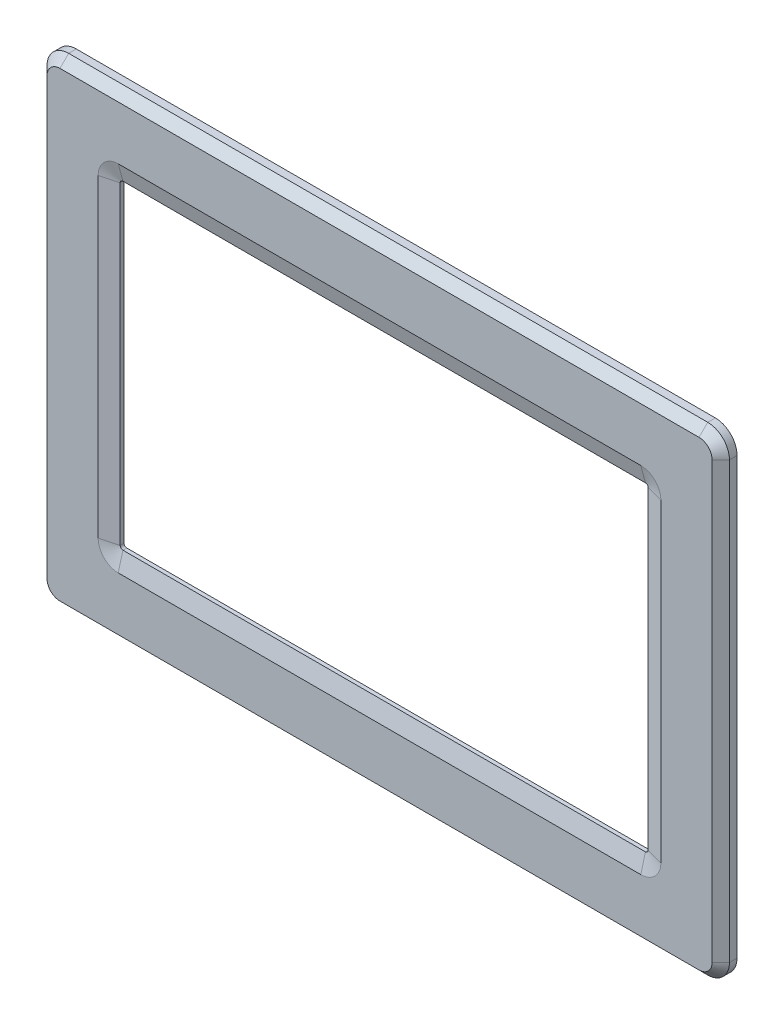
from build123d import *

# Parameters (mm, degrees)
SKETCH1_W                 = 199.62
SKETCH1_H                 = 140.02
EXTRUDE1_DEPTH            = 4.7625
CUT_EXTRUDE1_DEPTH        = 123.008678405
SKETCH3_W                 = 167.108
SKETCH3_H                 = 107.508
CUT_EXTRUDE2_DEPTH        = 2.286
EXTRUDE6_DEPTH            = 2.286
EXTRUDE5_DEPTH            = 2.286
CHAMFER1_SIZE             = 5.08
CHAMFER1_SIZE2            = 1.361181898
FILLET1_R                 = 6.35
CHAMFER2_SIZE             = 2.54
EXTRUDE2_DEPTH            = 0.762
EXTRUDE3_DEPTH            = 1.016
F_2_56_TAPPED_HOLE1_D     = 1.778
F_2_56_TAPPED_HOLE1_DEPTH = 3.302
EXTRUDE4_DEPTH            = 1.016
SKETCH11_R                = 2.1844
EXTRUDE7_DEPTH            = 2.032


with BuildPart() as part:
    # Sketch1 → Extrude1 (new body)
    with BuildSketch(Plane.XY):
        Rectangle(SKETCH1_W, SKETCH1_H)
    extrude(amount=EXTRUDE1_DEPTH)

    # Sketch2 → Cut-Extrude1 (cut, through all)
    with BuildSketch(Plane.XY.offset(4.7625)):
        with BuildLine():
            Line((77.216, -45.94098), (77.216, 45.94098))
            ThreePointArc((77.216, 45.94098), (76.983144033, 46.503144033), (76.42098, 46.736))
            Line((76.42098, 46.736), (-76.42098, 46.736))
            ThreePointArc((-76.42098, 46.736), (-76.983144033, 46.503144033), (-77.216, 45.94098))
            Line((-77.216, 45.94098), (-77.216, -45.94098))
            ThreePointArc((-77.216, -45.94098), (-76.983144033, -46.503144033), (-76.42098, -46.736))
            Line((-76.42098, -46.736), (76.42098, -46.736))
            ThreePointArc((76.42098, -46.736), (76.983144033, -46.503144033), (77.216, -45.94098))
        make_face()
    extrude(amount=-CUT_EXTRUDE1_DEPTH, mode=Mode.SUBTRACT)

    # Sketch3 → Cut-Extrude2 (cut)
    with BuildSketch(Plane(origin=(0, 0, 0), x_dir=(-1, 0, 0), z_dir=(0, 0, -1))):
        Rectangle(SKETCH3_W, SKETCH3_H)
    extrude(amount=-CUT_EXTRUDE2_DEPTH, mode=Mode.SUBTRACT)

    # Sketch10 → Extrude6 (cut)
    with BuildSketch(Plane(origin=(0, 0, 0), x_dir=(-1, 0, 0), z_dir=(0, 0, -1))):
        with BuildLine():
            Line((81.649, 12.7), (81.649, -12.7))
            ThreePointArc((81.649, -12.7), (83.89406403, -11.77006403), (84.824, -9.525))
            Line((84.824, -9.525), (84.824, 9.525))
            ThreePointArc((84.824, 9.525), (83.89406403, 11.77006403), (81.649, 12.7))
        make_face()
        with BuildLine():
            Line((-84.824, 9.525), (-84.824, -9.525))
            ThreePointArc((-84.824, -9.525), (-83.89406403, -11.77006403), (-81.649, -12.7))
            Line((-81.649, -12.7), (-81.649, 12.7))
            ThreePointArc((-81.649, 12.7), (-83.89406403, 11.77006403), (-84.824, 9.525))
        make_face()
    extrude(amount=-EXTRUDE6_DEPTH, mode=Mode.SUBTRACT)

    # Sketch9 → Extrude5 (cut)
    with BuildSketch(Plane(origin=(0, 0, 0), x_dir=(-1, 0, 0), z_dir=(0, 0, -1))):
        with BuildLine():
            Line((-83.554, 53.754), (-81.9665, 53.754))
            ThreePointArc((-81.9665, 53.754), (-82.76025, 54.54775), (-83.554, 53.754))
        make_face()
        with BuildLine():
            Line((83.554, 53.754), (81.9665, 53.754))
            ThreePointArc((81.9665, 53.754), (82.76025, 54.54775), (83.554, 53.754))
        make_face()
        with BuildLine():
            Line((83.554, -53.754), (81.9665, -53.754))
            ThreePointArc((81.9665, -53.754), (82.76025, -54.54775), (83.554, -53.754))
        make_face()
        with BuildLine():
            Line((-83.554, -53.754), (-81.9665, -53.754))
            ThreePointArc((-81.9665, -53.754), (-82.76025, -54.54775), (-83.554, -53.754))
        make_face()
    extrude(amount=-EXTRUDE5_DEPTH, mode=Mode.SUBTRACT)

    # Chamfer1
    chamfer1_edges = [part.edges().sort_by_distance(p)[0] for p in [
        (-76.983144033, 46.503144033, 4.7625),
        (-77.216, 0, 4.7625),
        (-76.983144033, -46.503144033, 4.7625),
        (0, -46.736, 4.7625),
        (76.983144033, -46.503144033, 4.7625),
        (77.216, 0, 4.7625),
        (76.983144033, 46.503144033, 4.7625),
        (0, 46.736, 4.7625),
    ]]
    chamfer1_side = [part.faces().sort_by_distance(p)[0] for p in [
        (0, 67.57168614, 4.7625),
    ]]
    chamfer(chamfer1_edges, length=CHAMFER1_SIZE, length2=CHAMFER1_SIZE2, reference=chamfer1_side[0])

    # Fillet1
    fillet1_edges = [part.edges().sort_by_distance(p)[0] for p in [
        (-99.81, 70.01, 2.38125),
        (99.81, 70.01, 2.38125),
        (99.81, -70.01, 2.38125),
        (-99.81, -70.01, 2.38125),
    ]]
    fillet(fillet1_edges, radius=FILLET1_R)

    # Chamfer2
    chamfer2_edges = [part.edges().sort_by_distance(p)[0] for p in [
        (0, -70.01, 4.7625),
        (-99.81, 0, 4.7625),
        (99.81, 0, 4.7625),
        (0, 70.01, 4.7625),
        (-97.950128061, 68.150128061, 4.7625),
        (97.950128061, 68.150128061, 4.7625),
        (97.950128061, -68.150128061, 4.7625),
        (-97.950128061, -68.150128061, 4.7625),
    ]]
    chamfer(chamfer2_edges, length=CHAMFER2_SIZE)

    # Sketch4 → Extrude2 (cut)
    with BuildSketch(Plane(origin=(0, 0, 0), x_dir=(-1, 0, 0), z_dir=(0, 0, -1))):
        with BuildLine():
            Line((98.0574, -63.37298), (98.0574, 63.37298))
            ThreePointArc((98.0574, 63.37298), (96.626786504, 66.826786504), (93.17298, 68.2574))
            Line((93.17298, 68.2574), (-93.17298, 68.2574))
            ThreePointArc((-93.17298, 68.2574), (-96.626786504, 66.826786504), (-98.0574, 63.37298))
            Line((-98.0574, 63.37298), (-98.0574, -63.37298))
            ThreePointArc((-98.0574, -63.37298), (-96.626786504, -66.826786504), (-93.17298, -68.2574))
            Line((-93.17298, -68.2574), (93.17298, -68.2574))
            ThreePointArc((93.17298, -68.2574), (96.626786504, -66.826786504), (98.0574, -63.37298))
        make_face()
        with BuildLine():
            Line((93.968, -63.37298), (93.968, 63.37298))
            ThreePointArc((93.968, 63.37298), (93.735144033, 63.935144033), (93.17298, 64.168))
            Line((93.17298, 64.168), (-93.17298, 64.168))
            ThreePointArc((-93.17298, 64.168), (-93.735144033, 63.935144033), (-93.968, 63.37298))
            Line((-93.968, 63.37298), (-93.968, -63.37298))
            ThreePointArc((-93.968, -63.37298), (-93.735144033, -63.935144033), (-93.17298, -64.168))
            Line((-93.17298, -64.168), (93.17298, -64.168))
            ThreePointArc((93.17298, -64.168), (93.735144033, -63.935144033), (93.968, -63.37298))
        make_face(mode=Mode.SUBTRACT)
    extrude(amount=-EXTRUDE2_DEPTH, mode=Mode.SUBTRACT)

    # Sketch5 → Extrude3 (cut)
    with BuildSketch(Plane(origin=(0, 0, 0), x_dir=(-1, 0, 0), z_dir=(0, 0, -1))):
        with BuildLine():
            Line((83.058, 54.4525), (83.058, 59.596))
            ThreePointArc((83.058, 59.596), (82.053669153, 62.020669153), (79.629, 63.025))
            Line((79.629, 63.025), (-79.629, 63.025))
            ThreePointArc((-79.629, 63.025), (-82.053669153, 62.020669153), (-83.058, 59.596))
            Line((-83.058, 59.596), (-83.058, 54.4525))
            ThreePointArc((-83.058, 54.4525), (-82.593032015, 53.329967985), (-81.4705, 52.865))
            Line((-81.4705, 52.865), (81.4705, 52.865))
            ThreePointArc((81.4705, 52.865), (82.593032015, 53.329967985), (83.058, 54.4525))
        make_face()
        with BuildLine():
            Line((81.4705, -52.865), (-81.4705, -52.865))
            ThreePointArc((-81.4705, -52.865), (-82.593032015, -53.329967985), (-83.058, -54.4525))
            Line((-83.058, -54.4525), (-83.058, -59.596))
            ThreePointArc((-83.058, -59.596), (-82.053669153, -62.020669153), (-79.629, -63.025))
            Line((-79.629, -63.025), (79.629, -63.025))
            ThreePointArc((79.629, -63.025), (82.053669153, -62.020669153), (83.058, -59.596))
            Line((83.058, -59.596), (83.058, -54.4525))
            ThreePointArc((83.058, -54.4525), (82.593032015, -53.329967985), (81.4705, -52.865))
        make_face()
    extrude(amount=-EXTRUDE3_DEPTH, mode=Mode.SUBTRACT)

    # 2-56 Tapped Hole1
    with Locations(Plane(origin=(0, 0, 1.016), x_dir=(-1, 0, 0), z_dir=(0, 0, -1))):
        with Locations((-75.441552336, 59.596), (0, 59.596), (75.441552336, 59.596), (75.441552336, -59.596), (0, -59.596), (-75.441552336, -59.596)):
            Hole(F_2_56_TAPPED_HOLE1_D / 2, depth=F_2_56_TAPPED_HOLE1_DEPTH)

    # Sketch8 → Extrude4 (cut)
    with BuildSketch(Plane(origin=(0, 0, 2.286), x_dir=(-1, 0, 0), z_dir=(0, 0, -1))):
        with BuildLine():
            Line((76.42098, 51.689), (-76.42098, 51.689))
            ThreePointArc((-76.42098, 51.689), (-80.48544392, 50.00544392), (-82.169, 45.94098))
            Line((-82.169, 45.94098), (-82.169, -45.94098))
            ThreePointArc((-82.169, -45.94098), (-80.48544392, -50.00544392), (-76.42098, -51.689))
            Line((-76.42098, -51.689), (76.42098, -51.689))
            ThreePointArc((76.42098, -51.689), (80.48544392, -50.00544392), (82.169, -45.94098))
            Line((82.169, -45.94098), (82.169, 45.94098))
            ThreePointArc((82.169, 45.94098), (80.48544392, 50.00544392), (76.42098, 51.689))
        make_face()
        with BuildLine():
            Line((76.42098, 48.387), (-76.42098, 48.387))
            ThreePointArc((-76.42098, 48.387), (-78.150577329, 47.670577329), (-78.867, 45.94098))
            Line((-78.867, 45.94098), (-78.867, -45.94098))
            ThreePointArc((-78.867, -45.94098), (-78.150577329, -47.670577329), (-76.42098, -48.387))
            Line((-76.42098, -48.387), (76.42098, -48.387))
            ThreePointArc((76.42098, -48.387), (78.150577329, -47.670577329), (78.867, -45.94098))
            Line((78.867, -45.94098), (78.867, 45.94098))
            ThreePointArc((78.867, 45.94098), (78.150577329, 47.670577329), (76.42098, 48.387))
        make_face(mode=Mode.SUBTRACT)
    extrude(amount=-EXTRUDE4_DEPTH, mode=Mode.SUBTRACT)

    # Sketch11 → Extrude7 (cut)
    with BuildSketch(Plane(origin=(0, 0, 1.016), x_dir=(-1, 0, 0), z_dir=(0, 0, -1))):
        with Locations((-62.741552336, 59.596)):
            Circle(SKETCH11_R)
        with Locations(Location((62.741552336, 59.596, 0), (0, 0, 180))):
            Circle(SKETCH11_R)
        with Locations((62.741552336, -59.596)):
            Circle(SKETCH11_R)
        with Locations(Location((-62.741552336, -59.596, 0), (0, 0, 180))):
            Circle(SKETCH11_R)
    extrude(amount=-EXTRUDE7_DEPTH, mode=Mode.SUBTRACT)


solid = part.part
